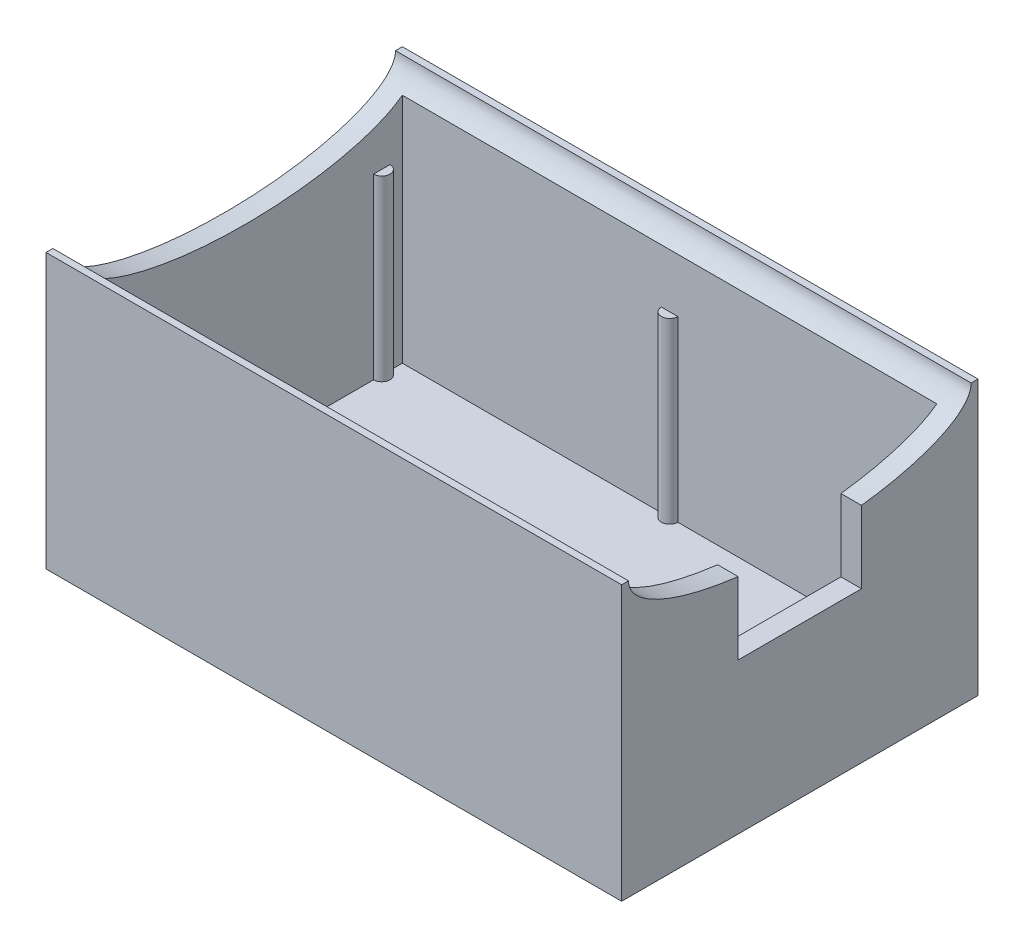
ISO-10303-21;
HEADER;
FILE_DESCRIPTION(('STEP AP214'),'2;1');
FILE_NAME('part.step','',(''),(''),'','','');
FILE_SCHEMA(('AUTOMOTIVE_DESIGN { 1 0 10303 214 1 1 1 1 }'));
ENDSEC;
DATA;
#1=APPLICATION_CONTEXT('core data for automotive mechanical design processes');
#2=APPLICATION_PROTOCOL_DEFINITION('international standard','automotive_design',2000,#1);
#3=PRODUCT_CONTEXT('',#1,'mechanical');
#4=PRODUCT('Part','Part','',(#3));
#5=PRODUCT_RELATED_PRODUCT_CATEGORY('part','',(#4));
#6=PRODUCT_DEFINITION_FORMATION('','',#4);
#7=PRODUCT_DEFINITION_CONTEXT('part definition',#1,'design');
#8=PRODUCT_DEFINITION('design','',#6,#7);
#9=PRODUCT_DEFINITION_SHAPE('','',#8);
#10=(LENGTH_UNIT() NAMED_UNIT(*) SI_UNIT(.MILLI.,.METRE.));
#11=(NAMED_UNIT(*) PLANE_ANGLE_UNIT() SI_UNIT($,.RADIAN.));
#12=(NAMED_UNIT(*) SI_UNIT($,.STERADIAN.) SOLID_ANGLE_UNIT());
#13=UNCERTAINTY_MEASURE_WITH_UNIT(LENGTH_MEASURE(1.E-05),#10,'distance_accuracy_value','');
#14=(GEOMETRIC_REPRESENTATION_CONTEXT(3) GLOBAL_UNCERTAINTY_ASSIGNED_CONTEXT((#13)) GLOBAL_UNIT_ASSIGNED_CONTEXT((#10,
#11,#12)) REPRESENTATION_CONTEXT('',''));
#15=CARTESIAN_POINT('',(0.,0.,0.));
#16=DIRECTION('',(0.,0.,1.));
#17=DIRECTION('',(1.,0.,0.));
#18=AXIS2_PLACEMENT_3D('',#15,#16,#17);
#19=CARTESIAN_POINT('',(-1.5,20.,0.));
#20=DIRECTION('',(-1.,0.,0.));
#21=DIRECTION('',(0.,0.,1.));
#22=AXIS2_PLACEMENT_3D('',#19,#20,#21);
#23=PLANE('',#22);
#24=DIRECTION('',(0.,1.,0.));
#25=VECTOR('',#24,1.);
#26=CARTESIAN_POINT('',(-1.5,20.,-8.5));
#27=LINE('',#26,#25);
#28=CARTESIAN_POINT('',(-1.5,11.,-8.5));
#29=VERTEX_POINT('',#28);
#30=CARTESIAN_POINT('',(-1.5,16.268190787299,-8.5));
#31=VERTEX_POINT('',#30);
#32=EDGE_CURVE('E240',#29,#31,#27,.T.);
#33=ORIENTED_EDGE('',*,*,#32,.F.);
#34=DIRECTION('',(0.,0.,1.));
#35=VECTOR('',#34,1.);
#36=CARTESIAN_POINT('',(-1.5,11.,0.));
#37=LINE('',#36,#35);
#38=CARTESIAN_POINT('',(-1.5,11.,-17.5));
#39=VERTEX_POINT('',#38);
#40=EDGE_CURVE('E222',#39,#29,#37,.T.);
#41=ORIENTED_EDGE('',*,*,#40,.F.);
#42=DIRECTION('',(0.,-1.,0.));
#43=VECTOR('',#42,1.);
#44=CARTESIAN_POINT('',(-1.5,20.,-17.5));
#45=LINE('',#44,#43);
#46=CARTESIAN_POINT('',(-1.5,16.268190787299,-17.5));
#47=VERTEX_POINT('',#46);
#48=EDGE_CURVE('E237',#47,#39,#45,.T.);
#49=ORIENTED_EDGE('',*,*,#48,.F.);
#50=CARTESIAN_POINT('',(-1.5,20.,-13.));
#51=DIRECTION('',(-1.,0.,0.));
#52=DIRECTION('',(0.,0.,1.));
#53=AXIS2_PLACEMENT_3D('',#50,#51,#52);
#54=ELLIPSE('',#53,12.5,4.);
#55=CARTESIAN_POINT('',(-1.5,18.4323265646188,-24.5));
#56=VERTEX_POINT('',#55);
#57=EDGE_CURVE('E416',#56,#47,#54,.T.);
#58=ORIENTED_EDGE('',*,*,#57,.F.);
#59=DIRECTION('',(0.,-1.,0.));
#60=VECTOR('',#59,1.);
#61=CARTESIAN_POINT('',(-1.5,20.,-24.5));
#62=LINE('',#61,#60);
#63=CARTESIAN_POINT('',(-1.5,1.5,-24.5));
#64=VERTEX_POINT('',#63);
#65=EDGE_CURVE('E431',#56,#64,#62,.T.);
#66=ORIENTED_EDGE('',*,*,#65,.T.);
#67=DIRECTION('',(0.,0.,-1.));
#68=VECTOR('',#67,1.);
#69=CARTESIAN_POINT('',(-1.5,1.5,0.));
#70=LINE('',#69,#68);
#71=CARTESIAN_POINT('',(-1.5,1.5,-23.6));
#72=VERTEX_POINT('',#71);
#73=EDGE_CURVE('E474',#72,#64,#70,.T.);
#74=ORIENTED_EDGE('',*,*,#73,.F.);
#75=DIRECTION('',(0.,-1.,0.));
#76=VECTOR('',#75,1.);
#77=CARTESIAN_POINT('',(-1.5,14.5,-23.6));
#78=LINE('',#77,#76);
#79=CARTESIAN_POINT('',(-1.5,14.5,-23.6));
#80=VERTEX_POINT('',#79);
#81=EDGE_CURVE('E408',#72,#80,#78,.F.);
#82=ORIENTED_EDGE('',*,*,#81,.T.);
#83=DIRECTION('',(0.,0.,-1.));
#84=VECTOR('',#83,1.);
#85=CARTESIAN_POINT('',(-1.5,14.5,0.));
#86=LINE('',#85,#84);
#87=CARTESIAN_POINT('',(-1.5,14.5,-22.4));
#88=VERTEX_POINT('',#87);
#89=EDGE_CURVE('E402',#88,#80,#86,.T.);
#90=ORIENTED_EDGE('',*,*,#89,.F.);
#91=DIRECTION('',(0.,-1.,0.));
#92=VECTOR('',#91,1.);
#93=CARTESIAN_POINT('',(-1.5,14.5,-22.4));
#94=LINE('',#93,#92);
#95=CARTESIAN_POINT('',(-1.5,1.5,-22.4));
#96=VERTEX_POINT('',#95);
#97=EDGE_CURVE('E405',#88,#96,#94,.T.);
#98=ORIENTED_EDGE('',*,*,#97,.T.);
#99=CARTESIAN_POINT('',(-1.5,1.5,-3.6));
#100=VERTEX_POINT('',#99);
#101=EDGE_CURVE('E473',#100,#96,#70,.T.);
#102=ORIENTED_EDGE('',*,*,#101,.F.);
#103=DIRECTION('',(0.,-1.,0.));
#104=VECTOR('',#103,1.);
#105=CARTESIAN_POINT('',(-1.5,14.5,-3.6));
#106=LINE('',#105,#104);
#107=CARTESIAN_POINT('',(-1.5,14.5,-3.6));
#108=VERTEX_POINT('',#107);
#109=EDGE_CURVE('E64',#100,#108,#106,.F.);
#110=ORIENTED_EDGE('',*,*,#109,.T.);
#111=DIRECTION('',(0.,0.,-1.));
#112=VECTOR('',#111,1.);
#113=CARTESIAN_POINT('',(-1.5,14.5,0.));
#114=LINE('',#113,#112);
#115=CARTESIAN_POINT('',(-1.5,14.5,-2.4));
#116=VERTEX_POINT('',#115);
#117=EDGE_CURVE('E412',#116,#108,#114,.T.);
#118=ORIENTED_EDGE('',*,*,#117,.F.);
#119=DIRECTION('',(0.,-1.,0.));
#120=VECTOR('',#119,1.);
#121=CARTESIAN_POINT('',(-1.5,14.5,-2.4));
#122=LINE('',#121,#120);
#123=CARTESIAN_POINT('',(-1.5,1.5,-2.4));
#124=VERTEX_POINT('',#123);
#125=EDGE_CURVE('E246',#116,#124,#122,.T.);
#126=ORIENTED_EDGE('',*,*,#125,.T.);
#127=CARTESIAN_POINT('',(-1.5,1.5,-1.5));
#128=VERTEX_POINT('',#127);
#129=EDGE_CURVE('E443',#128,#124,#70,.T.);
#130=ORIENTED_EDGE('',*,*,#129,.F.);
#131=DIRECTION('',(0.,-1.,0.));
#132=VECTOR('',#131,1.);
#133=CARTESIAN_POINT('',(-1.5,20.,-1.5));
#134=LINE('',#133,#132);
#135=CARTESIAN_POINT('',(-1.5,18.4323265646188,-1.5));
#136=VERTEX_POINT('',#135);
#137=EDGE_CURVE('E445',#136,#128,#134,.T.);
#138=ORIENTED_EDGE('',*,*,#137,.F.);
#139=EDGE_CURVE('E481',#31,#136,#54,.T.);
#140=ORIENTED_EDGE('',*,*,#139,.F.);
#141=EDGE_LOOP('',(#33,#41,#49,#58,#66,#74,#82,#90,#98,#102,#110,#118,#126,#130,#138,#140));
#142=FACE_BOUND('',#141,.T.);
#143=ADVANCED_FACE('F41',(#142),#23,.T.);
#144=CARTESIAN_POINT('',(0.,20.,-24.5));
#145=DIRECTION('',(0.,0.,1.));
#146=DIRECTION('',(1.,0.,0.));
#147=AXIS2_PLACEMENT_3D('',#144,#145,#146);
#148=PLANE('',#147);
#149=DIRECTION('',(-1.,0.,0.));
#150=VECTOR('',#149,1.);
#151=CARTESIAN_POINT('',(0.,1.5,-24.5));
#152=LINE('',#151,#150);
#153=CARTESIAN_POINT('',(-21.6,1.5,-24.5));
#154=VERTEX_POINT('',#153);
#155=CARTESIAN_POINT('',(-40.5,1.5,-24.5));
#156=VERTEX_POINT('',#155);
#157=EDGE_CURVE('E451',#154,#156,#152,.T.);
#158=ORIENTED_EDGE('',*,*,#157,.F.);
#159=DIRECTION('',(0.,-1.,0.));
#160=VECTOR('',#159,1.);
#161=CARTESIAN_POINT('',(-21.6,14.5,-24.5));
#162=LINE('',#161,#160);
#163=CARTESIAN_POINT('',(-21.6,14.5,-24.5));
#164=VERTEX_POINT('',#163);
#165=EDGE_CURVE('E400',#154,#164,#162,.F.);
#166=ORIENTED_EDGE('',*,*,#165,.T.);
#167=DIRECTION('',(-1.,0.,0.));
#168=VECTOR('',#167,1.);
#169=CARTESIAN_POINT('',(0.,14.5,-24.5));
#170=LINE('',#169,#168);
#171=CARTESIAN_POINT('',(-20.4,14.5,-24.5));
#172=VERTEX_POINT('',#171);
#173=EDGE_CURVE('E395',#172,#164,#170,.T.);
#174=ORIENTED_EDGE('',*,*,#173,.F.);
#175=DIRECTION('',(0.,-1.,0.));
#176=VECTOR('',#175,1.);
#177=CARTESIAN_POINT('',(-20.4,14.5,-24.5));
#178=LINE('',#177,#176);
#179=CARTESIAN_POINT('',(-20.4,1.5,-24.5));
#180=VERTEX_POINT('',#179);
#181=EDGE_CURVE('E398',#172,#180,#178,.T.);
#182=ORIENTED_EDGE('',*,*,#181,.T.);
#183=EDGE_CURVE('E448',#64,#180,#152,.T.);
#184=ORIENTED_EDGE('',*,*,#183,.F.);
#185=ORIENTED_EDGE('',*,*,#65,.F.);
#186=DIRECTION('',(-1.,0.,0.));
#187=VECTOR('',#186,1.);
#188=CARTESIAN_POINT('',(0.,18.4323265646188,-24.5));
#189=LINE('',#188,#187);
#190=CARTESIAN_POINT('',(-40.5,18.4323265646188,-24.5));
#191=VERTEX_POINT('',#190);
#192=EDGE_CURVE('E482',#191,#56,#189,.F.);
#193=ORIENTED_EDGE('',*,*,#192,.F.);
#194=DIRECTION('',(0.,-1.,0.));
#195=VECTOR('',#194,1.);
#196=CARTESIAN_POINT('',(-40.5,20.,-24.5));
#197=LINE('',#196,#195);
#198=EDGE_CURVE('E433',#191,#156,#197,.T.);
#199=ORIENTED_EDGE('',*,*,#198,.T.);
#200=EDGE_LOOP('',(#158,#166,#174,#182,#184,#185,#193,#199));
#201=FACE_BOUND('',#200,.T.);
#202=ADVANCED_FACE('F304',(#201),#148,.T.);
#203=CARTESIAN_POINT('',(0.,20.,-1.5));
#204=DIRECTION('',(0.,0.,-1.));
#205=DIRECTION('',(-1.,0.,0.));
#206=AXIS2_PLACEMENT_3D('',#203,#204,#205);
#207=PLANE('',#206);
#208=DIRECTION('',(1.,0.,0.));
#209=VECTOR('',#208,1.);
#210=CARTESIAN_POINT('',(0.,1.5,-1.5));
#211=LINE('',#210,#209);
#212=CARTESIAN_POINT('',(-20.4,1.5,-1.5));
#213=VERTEX_POINT('',#212);
#214=EDGE_CURVE('E455',#213,#128,#211,.T.);
#215=ORIENTED_EDGE('',*,*,#214,.F.);
#216=DIRECTION('',(0.,-1.,0.));
#217=VECTOR('',#216,1.);
#218=CARTESIAN_POINT('',(-20.4,14.5,-1.5));
#219=LINE('',#218,#217);
#220=CARTESIAN_POINT('',(-20.4,14.5,-1.5));
#221=VERTEX_POINT('',#220);
#222=EDGE_CURVE('E393',#213,#221,#219,.F.);
#223=ORIENTED_EDGE('',*,*,#222,.T.);
#224=DIRECTION('',(1.,0.,0.));
#225=VECTOR('',#224,1.);
#226=CARTESIAN_POINT('',(0.,14.5,-1.5));
#227=LINE('',#226,#225);
#228=CARTESIAN_POINT('',(-21.6,14.5,-1.5));
#229=VERTEX_POINT('',#228);
#230=EDGE_CURVE('E388',#229,#221,#227,.T.);
#231=ORIENTED_EDGE('',*,*,#230,.F.);
#232=DIRECTION('',(0.,-1.,0.));
#233=VECTOR('',#232,1.);
#234=CARTESIAN_POINT('',(-21.6,14.5,-1.5));
#235=LINE('',#234,#233);
#236=CARTESIAN_POINT('',(-21.6,1.5,-1.5));
#237=VERTEX_POINT('',#236);
#238=EDGE_CURVE('E391',#229,#237,#235,.T.);
#239=ORIENTED_EDGE('',*,*,#238,.T.);
#240=CARTESIAN_POINT('',(-40.5,1.5,-1.5));
#241=VERTEX_POINT('',#240);
#242=EDGE_CURVE('E426',#241,#237,#211,.T.);
#243=ORIENTED_EDGE('',*,*,#242,.F.);
#244=DIRECTION('',(0.,-1.,0.));
#245=VECTOR('',#244,1.);
#246=CARTESIAN_POINT('',(-40.5,20.,-1.5));
#247=LINE('',#246,#245);
#248=CARTESIAN_POINT('',(-40.5,18.4323265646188,-1.5));
#249=VERTEX_POINT('',#248);
#250=EDGE_CURVE('E439',#249,#241,#247,.T.);
#251=ORIENTED_EDGE('',*,*,#250,.F.);
#252=DIRECTION('',(-1.,0.,0.));
#253=VECTOR('',#252,1.);
#254=CARTESIAN_POINT('',(0.,18.4323265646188,-1.5));
#255=LINE('',#254,#253);
#256=EDGE_CURVE('E377',#136,#249,#255,.T.);
#257=ORIENTED_EDGE('',*,*,#256,.F.);
#258=ORIENTED_EDGE('',*,*,#137,.T.);
#259=EDGE_LOOP('',(#215,#223,#231,#239,#243,#251,#257,#258));
#260=FACE_BOUND('',#259,.T.);
#261=ADVANCED_FACE('F308',(#260),#207,.T.);
#262=CARTESIAN_POINT('',(-40.5,20.,0.));
#263=DIRECTION('',(1.,0.,0.));
#264=DIRECTION('',(0.,0.,-1.));
#265=AXIS2_PLACEMENT_3D('',#262,#263,#264);
#266=PLANE('',#265);
#267=DIRECTION('',(0.,0.,1.));
#268=VECTOR('',#267,1.);
#269=CARTESIAN_POINT('',(-40.5,1.5,0.));
#270=LINE('',#269,#268);
#271=CARTESIAN_POINT('',(-40.5,1.5,-2.4));
#272=VERTEX_POINT('',#271);
#273=EDGE_CURVE('E450',#272,#241,#270,.T.);
#274=ORIENTED_EDGE('',*,*,#273,.F.);
#275=DIRECTION('',(0.,-1.,0.));
#276=VECTOR('',#275,1.);
#277=CARTESIAN_POINT('',(-40.5,14.5,-2.4));
#278=LINE('',#277,#276);
#279=CARTESIAN_POINT('',(-40.5,14.5,-2.4));
#280=VERTEX_POINT('',#279);
#281=EDGE_CURVE('E276',#272,#280,#278,.F.);
#282=ORIENTED_EDGE('',*,*,#281,.T.);
#283=DIRECTION('',(0.,0.,1.));
#284=VECTOR('',#283,1.);
#285=CARTESIAN_POINT('',(-40.5,14.5,0.));
#286=LINE('',#285,#284);
#287=CARTESIAN_POINT('',(-40.5,14.5,-3.6));
#288=VERTEX_POINT('',#287);
#289=EDGE_CURVE('E386',#288,#280,#286,.T.);
#290=ORIENTED_EDGE('',*,*,#289,.F.);
#291=DIRECTION('',(0.,-1.,0.));
#292=VECTOR('',#291,1.);
#293=CARTESIAN_POINT('',(-40.5,14.5,-3.6));
#294=LINE('',#293,#292);
#295=CARTESIAN_POINT('',(-40.5,1.5,-3.6));
#296=VERTEX_POINT('',#295);
#297=EDGE_CURVE('E271',#288,#296,#294,.T.);
#298=ORIENTED_EDGE('',*,*,#297,.T.);
#299=CARTESIAN_POINT('',(-40.5,1.5,-22.4));
#300=VERTEX_POINT('',#299);
#301=EDGE_CURVE('E456',#300,#296,#270,.T.);
#302=ORIENTED_EDGE('',*,*,#301,.F.);
#303=DIRECTION('',(0.,-1.,0.));
#304=VECTOR('',#303,1.);
#305=CARTESIAN_POINT('',(-40.5,14.5,-22.4));
#306=LINE('',#305,#304);
#307=CARTESIAN_POINT('',(-40.5,14.5,-22.4));
#308=VERTEX_POINT('',#307);
#309=EDGE_CURVE('E384',#300,#308,#306,.F.);
#310=ORIENTED_EDGE('',*,*,#309,.T.);
#311=DIRECTION('',(0.,0.,1.));
#312=VECTOR('',#311,1.);
#313=CARTESIAN_POINT('',(-40.5,14.5,0.));
#314=LINE('',#313,#312);
#315=CARTESIAN_POINT('',(-40.5,14.5,-23.6));
#316=VERTEX_POINT('',#315);
#317=EDGE_CURVE('E379',#316,#308,#314,.T.);
#318=ORIENTED_EDGE('',*,*,#317,.F.);
#319=DIRECTION('',(0.,-1.,0.));
#320=VECTOR('',#319,1.);
#321=CARTESIAN_POINT('',(-40.5,14.5,-23.6));
#322=LINE('',#321,#320);
#323=CARTESIAN_POINT('',(-40.5,1.5,-23.6));
#324=VERTEX_POINT('',#323);
#325=EDGE_CURVE('E382',#316,#324,#322,.T.);
#326=ORIENTED_EDGE('',*,*,#325,.T.);
#327=EDGE_CURVE('E453',#156,#324,#270,.T.);
#328=ORIENTED_EDGE('',*,*,#327,.F.);
#329=ORIENTED_EDGE('',*,*,#198,.F.);
#330=CARTESIAN_POINT('',(-40.5,20.,-13.));
#331=DIRECTION('',(-1.,0.,0.));
#332=DIRECTION('',(0.,0.,1.));
#333=AXIS2_PLACEMENT_3D('',#330,#331,#332);
#334=ELLIPSE('',#333,12.5,4.);
#335=EDGE_CURVE('E289',#249,#191,#334,.F.);
#336=ORIENTED_EDGE('',*,*,#335,.F.);
#337=ORIENTED_EDGE('',*,*,#250,.T.);
#338=EDGE_LOOP('',(#274,#282,#290,#298,#302,#310,#318,#326,#328,#329,#336,#337));
#339=FACE_BOUND('',#338,.T.);
#340=ADVANCED_FACE('F310',(#339),#266,.T.);
#341=CARTESIAN_POINT('',(0.,20.,0.));
#342=DIRECTION('',(0.,1.,0.));
#343=DIRECTION('',(0.,0.,1.));
#344=AXIS2_PLACEMENT_3D('',#341,#342,#343);
#345=PLANE('',#344);
#346=DIRECTION('',(-1.,0.,0.));
#347=VECTOR('',#346,1.);
#348=CARTESIAN_POINT('',(0.,20.,-25.5));
#349=LINE('',#348,#347);
#350=CARTESIAN_POINT('',(0.,20.,-25.5));
#351=VERTEX_POINT('',#350);
#352=CARTESIAN_POINT('',(-42.,20.,-25.5));
#353=VERTEX_POINT('',#352);
#354=EDGE_CURVE('E475',#351,#353,#349,.T.);
#355=ORIENTED_EDGE('',*,*,#354,.F.);
#356=DIRECTION('',(0.,0.,-1.));
#357=VECTOR('',#356,1.);
#358=CARTESIAN_POINT('',(0.,20.,0.));
#359=LINE('',#358,#357);
#360=CARTESIAN_POINT('',(0.,20.,-26.));
#361=VERTEX_POINT('',#360);
#362=EDGE_CURVE('E367',#351,#361,#359,.T.);
#363=ORIENTED_EDGE('',*,*,#362,.T.);
#364=DIRECTION('',(-1.,0.,0.));
#365=VECTOR('',#364,1.);
#366=CARTESIAN_POINT('',(0.,20.,-26.));
#367=LINE('',#366,#365);
#368=CARTESIAN_POINT('',(-42.,20.,-26.));
#369=VERTEX_POINT('',#368);
#370=EDGE_CURVE('E423',#361,#369,#367,.T.);
#371=ORIENTED_EDGE('',*,*,#370,.T.);
#372=DIRECTION('',(0.,0.,1.));
#373=VECTOR('',#372,1.);
#374=CARTESIAN_POINT('',(-42.,20.,0.));
#375=LINE('',#374,#373);
#376=EDGE_CURVE('E361',#369,#353,#375,.T.);
#377=ORIENTED_EDGE('',*,*,#376,.T.);
#378=EDGE_LOOP('',(#355,#363,#371,#377));
#379=FACE_BOUND('',#378,.T.);
#380=ADVANCED_FACE('F313',(#379),#345,.T.);
#381=CARTESIAN_POINT('',(0.,20.,0.));
#382=DIRECTION('',(-1.,0.,0.));
#383=DIRECTION('',(0.,0.,1.));
#384=AXIS2_PLACEMENT_3D('',#381,#382,#383);
#385=PLANE('',#384);
#386=DIRECTION('',(0.,0.,-1.));
#387=VECTOR('',#386,1.);
#388=CARTESIAN_POINT('',(0.,11.,-8.5));
#389=LINE('',#388,#387);
#390=CARTESIAN_POINT('',(0.,11.,-8.5));
#391=VERTEX_POINT('',#390);
#392=CARTESIAN_POINT('',(0.,11.,-17.5));
#393=VERTEX_POINT('',#392);
#394=EDGE_CURVE('E220',#391,#393,#389,.T.);
#395=ORIENTED_EDGE('',*,*,#394,.F.);
#396=DIRECTION('',(0.,-1.,0.));
#397=VECTOR('',#396,1.);
#398=CARTESIAN_POINT('',(0.,20.8938766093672,-8.5));
#399=LINE('',#398,#397);
#400=CARTESIAN_POINT('',(0.,16.268190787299,-8.5));
#401=VERTEX_POINT('',#400);
#402=EDGE_CURVE('E228',#401,#391,#399,.T.);
#403=ORIENTED_EDGE('',*,*,#402,.F.);
#404=CARTESIAN_POINT('',(0.,20.,-13.));
#405=DIRECTION('',(-1.,0.,0.));
#406=DIRECTION('',(0.,0.,1.));
#407=AXIS2_PLACEMENT_3D('',#404,#405,#406);
#408=ELLIPSE('',#407,12.5,4.);
#409=CARTESIAN_POINT('',(0.,20.,-0.499999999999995));
#410=VERTEX_POINT('',#409);
#411=EDGE_CURVE('E290',#401,#410,#408,.T.);
#412=ORIENTED_EDGE('',*,*,#411,.T.);
#413=CARTESIAN_POINT('',(0.,20.,0.));
#414=VERTEX_POINT('',#413);
#415=EDGE_CURVE('E420',#414,#410,#359,.T.);
#416=ORIENTED_EDGE('',*,*,#415,.F.);
#417=DIRECTION('',(0.,-1.,0.));
#418=VECTOR('',#417,1.);
#419=CARTESIAN_POINT('',(0.,20.,0.));
#420=LINE('',#419,#418);
#421=CARTESIAN_POINT('',(0.,0.,0.));
#422=VERTEX_POINT('',#421);
#423=EDGE_CURVE('E371',#414,#422,#420,.T.);
#424=ORIENTED_EDGE('',*,*,#423,.T.);
#425=DIRECTION('',(0.,0.,-1.));
#426=VECTOR('',#425,1.);
#427=CARTESIAN_POINT('',(0.,0.,0.));
#428=LINE('',#427,#426);
#429=CARTESIAN_POINT('',(0.,0.,-26.));
#430=VERTEX_POINT('',#429);
#431=EDGE_CURVE('E354',#422,#430,#428,.T.);
#432=ORIENTED_EDGE('',*,*,#431,.T.);
#433=DIRECTION('',(0.,-1.,0.));
#434=VECTOR('',#433,1.);
#435=CARTESIAN_POINT('',(0.,20.,-26.));
#436=LINE('',#435,#434);
#437=EDGE_CURVE('E349',#361,#430,#436,.T.);
#438=ORIENTED_EDGE('',*,*,#437,.F.);
#439=ORIENTED_EDGE('',*,*,#362,.F.);
#440=CARTESIAN_POINT('',(0.,16.268190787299,-17.5));
#441=VERTEX_POINT('',#440);
#442=EDGE_CURVE('E286',#351,#441,#408,.T.);
#443=ORIENTED_EDGE('',*,*,#442,.T.);
#444=DIRECTION('',(0.,1.,0.));
#445=VECTOR('',#444,1.);
#446=CARTESIAN_POINT('',(0.,20.8938766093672,-17.5));
#447=LINE('',#446,#445);
#448=EDGE_CURVE('E56',#393,#441,#447,.T.);
#449=ORIENTED_EDGE('',*,*,#448,.F.);
#450=EDGE_LOOP('',(#395,#403,#412,#416,#424,#432,#438,#439,#443,#449));
#451=FACE_BOUND('',#450,.T.);
#452=ADVANCED_FACE('F43',(#451),#385,.F.);
#453=CARTESIAN_POINT('',(0.,20.,-26.));
#454=DIRECTION('',(0.,0.,1.));
#455=DIRECTION('',(1.,0.,0.));
#456=AXIS2_PLACEMENT_3D('',#453,#454,#455);
#457=PLANE('',#456);
#458=DIRECTION('',(-1.,0.,0.));
#459=VECTOR('',#458,1.);
#460=CARTESIAN_POINT('',(0.,0.,-26.));
#461=LINE('',#460,#459);
#462=CARTESIAN_POINT('',(-42.,0.,-26.));
#463=VERTEX_POINT('',#462);
#464=EDGE_CURVE('E343',#430,#463,#461,.T.);
#465=ORIENTED_EDGE('',*,*,#464,.T.);
#466=DIRECTION('',(0.,-1.,0.));
#467=VECTOR('',#466,1.);
#468=CARTESIAN_POINT('',(-42.,20.,-26.));
#469=LINE('',#468,#467);
#470=EDGE_CURVE('E346',#369,#463,#469,.T.);
#471=ORIENTED_EDGE('',*,*,#470,.F.);
#472=ORIENTED_EDGE('',*,*,#370,.F.);
#473=ORIENTED_EDGE('',*,*,#437,.T.);
#474=EDGE_LOOP('',(#465,#471,#472,#473));
#475=FACE_BOUND('',#474,.T.);
#476=ADVANCED_FACE('F334',(#475),#457,.F.);
#477=CARTESIAN_POINT('',(-42.,20.,0.));
#478=DIRECTION('',(1.,0.,0.));
#479=DIRECTION('',(0.,0.,-1.));
#480=AXIS2_PLACEMENT_3D('',#477,#478,#479);
#481=PLANE('',#480);
#482=CARTESIAN_POINT('',(-42.,20.,-0.499999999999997));
#483=VERTEX_POINT('',#482);
#484=CARTESIAN_POINT('',(-42.,20.,0.));
#485=VERTEX_POINT('',#484);
#486=EDGE_CURVE('E429',#483,#485,#375,.T.);
#487=ORIENTED_EDGE('',*,*,#486,.F.);
#488=CARTESIAN_POINT('',(-42.,20.,-13.));
#489=DIRECTION('',(-1.,0.,0.));
#490=DIRECTION('',(0.,0.,1.));
#491=AXIS2_PLACEMENT_3D('',#488,#489,#490);
#492=ELLIPSE('',#491,12.5,4.);
#493=EDGE_CURVE('E283',#353,#483,#492,.T.);
#494=ORIENTED_EDGE('',*,*,#493,.F.);
#495=ORIENTED_EDGE('',*,*,#376,.F.);
#496=ORIENTED_EDGE('',*,*,#470,.T.);
#497=DIRECTION('',(0.,0.,1.));
#498=VECTOR('',#497,1.);
#499=CARTESIAN_POINT('',(-42.,0.,0.));
#500=LINE('',#499,#498);
#501=CARTESIAN_POINT('',(-42.,0.,0.));
#502=VERTEX_POINT('',#501);
#503=EDGE_CURVE('E353',#463,#502,#500,.T.);
#504=ORIENTED_EDGE('',*,*,#503,.T.);
#505=DIRECTION('',(0.,-1.,0.));
#506=VECTOR('',#505,1.);
#507=CARTESIAN_POINT('',(-42.,20.,0.));
#508=LINE('',#507,#506);
#509=EDGE_CURVE('E362',#485,#502,#508,.T.);
#510=ORIENTED_EDGE('',*,*,#509,.F.);
#511=EDGE_LOOP('',(#487,#494,#495,#496,#504,#510));
#512=FACE_BOUND('',#511,.T.);
#513=ADVANCED_FACE('F331',(#512),#481,.F.);
#514=CARTESIAN_POINT('',(0.,20.,0.));
#515=DIRECTION('',(0.,0.,-1.));
#516=DIRECTION('',(-1.,0.,0.));
#517=AXIS2_PLACEMENT_3D('',#514,#515,#516);
#518=PLANE('',#517);
#519=DIRECTION('',(1.,0.,0.));
#520=VECTOR('',#519,1.);
#521=CARTESIAN_POINT('',(0.,0.,0.));
#522=LINE('',#521,#520);
#523=EDGE_CURVE('E365',#502,#422,#522,.T.);
#524=ORIENTED_EDGE('',*,*,#523,.T.);
#525=ORIENTED_EDGE('',*,*,#423,.F.);
#526=DIRECTION('',(1.,0.,0.));
#527=VECTOR('',#526,1.);
#528=CARTESIAN_POINT('',(0.,20.,0.));
#529=LINE('',#528,#527);
#530=EDGE_CURVE('E374',#485,#414,#529,.T.);
#531=ORIENTED_EDGE('',*,*,#530,.F.);
#532=ORIENTED_EDGE('',*,*,#509,.T.);
#533=EDGE_LOOP('',(#524,#525,#531,#532));
#534=FACE_BOUND('',#533,.T.);
#535=ADVANCED_FACE('F324',(#534),#518,.F.);
#536=DIRECTION('',(-1.,0.,0.));
#537=VECTOR('',#536,1.);
#538=CARTESIAN_POINT('',(0.,20.,-0.499999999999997));
#539=LINE('',#538,#537);
#540=EDGE_CURVE('E476',#483,#410,#539,.F.);
#541=ORIENTED_EDGE('',*,*,#540,.F.);
#542=ORIENTED_EDGE('',*,*,#486,.T.);
#543=ORIENTED_EDGE('',*,*,#530,.T.);
#544=ORIENTED_EDGE('',*,*,#415,.T.);
#545=EDGE_LOOP('',(#541,#542,#543,#544));
#546=FACE_BOUND('',#545,.T.);
#547=ADVANCED_FACE('F321',(#546),#345,.T.);
#548=CARTESIAN_POINT('',(0.,0.,0.));
#549=DIRECTION('',(0.,1.,0.));
#550=DIRECTION('',(0.,0.,1.));
#551=AXIS2_PLACEMENT_3D('',#548,#549,#550);
#552=PLANE('',#551);
#553=ORIENTED_EDGE('',*,*,#431,.F.);
#554=ORIENTED_EDGE('',*,*,#523,.F.);
#555=ORIENTED_EDGE('',*,*,#503,.F.);
#556=ORIENTED_EDGE('',*,*,#464,.F.);
#557=EDGE_LOOP('',(#553,#554,#555,#556));
#558=FACE_BOUND('',#557,.T.);
#559=ADVANCED_FACE('F298',(#558),#552,.F.);
#560=DIRECTION('',(-1.,0.,0.));
#561=VECTOR('',#560,1.);
#562=SURFACE_OF_LINEAR_EXTRUSION('',#408,#561);
#563=ORIENTED_EDGE('',*,*,#411,.F.);
#564=DIRECTION('',(-1.,0.,0.));
#565=VECTOR('',#564,1.);
#566=CARTESIAN_POINT('',(0.,16.268190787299,-8.5));
#567=LINE('',#566,#565);
#568=EDGE_CURVE('E11',#401,#31,#567,.T.);
#569=ORIENTED_EDGE('',*,*,#568,.T.);
#570=ORIENTED_EDGE('',*,*,#139,.T.);
#571=ORIENTED_EDGE('',*,*,#256,.T.);
#572=ORIENTED_EDGE('',*,*,#335,.T.);
#573=ORIENTED_EDGE('',*,*,#192,.T.);
#574=ORIENTED_EDGE('',*,*,#57,.T.);
#575=DIRECTION('',(-1.,0.,0.));
#576=VECTOR('',#575,1.);
#577=CARTESIAN_POINT('',(0.,16.268190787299,-17.5));
#578=LINE('',#577,#576);
#579=EDGE_CURVE('E49',#47,#441,#578,.F.);
#580=ORIENTED_EDGE('',*,*,#579,.T.);
#581=ORIENTED_EDGE('',*,*,#442,.F.);
#582=ORIENTED_EDGE('',*,*,#354,.T.);
#583=ORIENTED_EDGE('',*,*,#493,.T.);
#584=ORIENTED_EDGE('',*,*,#540,.T.);
#585=EDGE_LOOP('',(#563,#569,#570,#571,#572,#573,#574,#580,#581,#582,#583,#584));
#586=FACE_BOUND('',#585,.T.);
#587=ADVANCED_FACE('F293',(#586),#562,.F.);
#588=CARTESIAN_POINT('',(0.,1.5,0.));
#589=DIRECTION('',(0.,1.,0.));
#590=DIRECTION('',(0.,0.,1.));
#591=AXIS2_PLACEMENT_3D('',#588,#589,#590);
#592=PLANE('',#591);
#593=ORIENTED_EDGE('',*,*,#129,.T.);
#594=CARTESIAN_POINT('',(-1.5,1.5,-3.));
#595=DIRECTION('',(0.,1.,0.));
#596=DIRECTION('',(0.,0.,1.));
#597=AXIS2_PLACEMENT_3D('',#594,#595,#596);
#598=CIRCLE('',#597,0.6);
#599=EDGE_CURVE('E410',#124,#100,#598,.F.);
#600=ORIENTED_EDGE('',*,*,#599,.T.);
#601=ORIENTED_EDGE('',*,*,#101,.T.);
#602=CARTESIAN_POINT('',(-1.5,1.5,-23.));
#603=DIRECTION('',(0.,1.,0.));
#604=DIRECTION('',(0.,0.,1.));
#605=AXIS2_PLACEMENT_3D('',#602,#603,#604);
#606=CIRCLE('',#605,0.6);
#607=EDGE_CURVE('E251',#72,#96,#606,.T.);
#608=ORIENTED_EDGE('',*,*,#607,.F.);
#609=ORIENTED_EDGE('',*,*,#73,.T.);
#610=ORIENTED_EDGE('',*,*,#183,.T.);
#611=CARTESIAN_POINT('',(-21.,1.5,-24.5));
#612=DIRECTION('',(0.,1.,0.));
#613=DIRECTION('',(0.,0.,1.));
#614=AXIS2_PLACEMENT_3D('',#611,#612,#613);
#615=CIRCLE('',#614,0.6);
#616=EDGE_CURVE('E257',#154,#180,#615,.T.);
#617=ORIENTED_EDGE('',*,*,#616,.F.);
#618=ORIENTED_EDGE('',*,*,#157,.T.);
#619=ORIENTED_EDGE('',*,*,#327,.T.);
#620=CARTESIAN_POINT('',(-40.5,1.5,-23.));
#621=DIRECTION('',(0.,1.,0.));
#622=DIRECTION('',(0.,0.,1.));
#623=AXIS2_PLACEMENT_3D('',#620,#621,#622);
#624=CIRCLE('',#623,0.6);
#625=EDGE_CURVE('E279',#300,#324,#624,.T.);
#626=ORIENTED_EDGE('',*,*,#625,.F.);
#627=ORIENTED_EDGE('',*,*,#301,.T.);
#628=CARTESIAN_POINT('',(-40.5,1.5,-3.));
#629=DIRECTION('',(0.,1.,0.));
#630=DIRECTION('',(0.,0.,1.));
#631=AXIS2_PLACEMENT_3D('',#628,#629,#630);
#632=CIRCLE('',#631,0.600000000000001);
#633=EDGE_CURVE('E269',#272,#296,#632,.T.);
#634=ORIENTED_EDGE('',*,*,#633,.F.);
#635=ORIENTED_EDGE('',*,*,#273,.T.);
#636=ORIENTED_EDGE('',*,*,#242,.T.);
#637=CARTESIAN_POINT('',(-21.,1.5,-1.5));
#638=DIRECTION('',(0.,1.,0.));
#639=DIRECTION('',(0.,0.,1.));
#640=AXIS2_PLACEMENT_3D('',#637,#638,#639);
#641=CIRCLE('',#640,0.6);
#642=EDGE_CURVE('E263',#213,#237,#641,.T.);
#643=ORIENTED_EDGE('',*,*,#642,.F.);
#644=ORIENTED_EDGE('',*,*,#214,.T.);
#645=EDGE_LOOP('',(#593,#600,#601,#608,#609,#610,#617,#618,#619,#626,#627,#634,#635,#636,#643,#644));
#646=FACE_BOUND('',#645,.T.);
#647=ADVANCED_FACE('F297',(#646),#592,.T.);
#648=CARTESIAN_POINT('',(-40.5,14.5,-23.));
#649=DIRECTION('',(0.,-1.,0.));
#650=DIRECTION('',(0.,0.,-1.));
#651=AXIS2_PLACEMENT_3D('',#648,#649,#650);
#652=CYLINDRICAL_SURFACE('',#651,0.6);
#653=ORIENTED_EDGE('',*,*,#309,.F.);
#654=ORIENTED_EDGE('',*,*,#625,.T.);
#655=ORIENTED_EDGE('',*,*,#325,.F.);
#656=CARTESIAN_POINT('',(-40.5,14.5,-23.));
#657=DIRECTION('',(0.,1.,0.));
#658=DIRECTION('',(0.,0.,1.));
#659=AXIS2_PLACEMENT_3D('',#656,#657,#658);
#660=CIRCLE('',#659,0.6);
#661=EDGE_CURVE('E280',#308,#316,#660,.T.);
#662=ORIENTED_EDGE('',*,*,#661,.F.);
#663=EDGE_LOOP('',(#653,#654,#655,#662));
#664=FACE_BOUND('',#663,.T.);
#665=ADVANCED_FACE('F300',(#664),#652,.T.);
#666=CARTESIAN_POINT('',(-40.5,14.5,-23.));
#667=DIRECTION('',(0.,1.,0.));
#668=DIRECTION('',(0.,0.,1.));
#669=AXIS2_PLACEMENT_3D('',#666,#667,#668);
#670=PLANE('',#669);
#671=ORIENTED_EDGE('',*,*,#661,.T.);
#672=ORIENTED_EDGE('',*,*,#317,.T.);
#673=EDGE_LOOP('',(#671,#672));
#674=FACE_BOUND('',#673,.T.);
#675=ADVANCED_FACE('F493',(#674),#670,.T.);
#676=CARTESIAN_POINT('',(-40.5,14.5,-3.));
#677=DIRECTION('',(0.,-1.,0.));
#678=DIRECTION('',(0.,0.,-1.));
#679=AXIS2_PLACEMENT_3D('',#676,#677,#678);
#680=CYLINDRICAL_SURFACE('',#679,0.600000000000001);
#681=ORIENTED_EDGE('',*,*,#281,.F.);
#682=ORIENTED_EDGE('',*,*,#633,.T.);
#683=ORIENTED_EDGE('',*,*,#297,.F.);
#684=CARTESIAN_POINT('',(-40.5,14.5,-3.));
#685=DIRECTION('',(0.,1.,0.));
#686=DIRECTION('',(0.,0.,1.));
#687=AXIS2_PLACEMENT_3D('',#684,#685,#686);
#688=CIRCLE('',#687,0.600000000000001);
#689=EDGE_CURVE('E266',#280,#288,#688,.T.);
#690=ORIENTED_EDGE('',*,*,#689,.F.);
#691=EDGE_LOOP('',(#681,#682,#683,#690));
#692=FACE_BOUND('',#691,.T.);
#693=ADVANCED_FACE('F495',(#692),#680,.T.);
#694=CARTESIAN_POINT('',(-40.5,14.5,-3.));
#695=DIRECTION('',(0.,1.,0.));
#696=DIRECTION('',(0.,0.,1.));
#697=AXIS2_PLACEMENT_3D('',#694,#695,#696);
#698=PLANE('',#697);
#699=ORIENTED_EDGE('',*,*,#689,.T.);
#700=ORIENTED_EDGE('',*,*,#289,.T.);
#701=EDGE_LOOP('',(#699,#700));
#702=FACE_BOUND('',#701,.T.);
#703=ADVANCED_FACE('F500',(#702),#698,.T.);
#704=CARTESIAN_POINT('',(-21.,14.5,-1.5));
#705=DIRECTION('',(0.,-1.,0.));
#706=DIRECTION('',(0.,0.,-1.));
#707=AXIS2_PLACEMENT_3D('',#704,#705,#706);
#708=CYLINDRICAL_SURFACE('',#707,0.6);
#709=ORIENTED_EDGE('',*,*,#222,.F.);
#710=ORIENTED_EDGE('',*,*,#642,.T.);
#711=ORIENTED_EDGE('',*,*,#238,.F.);
#712=CARTESIAN_POINT('',(-21.,14.5,-1.5));
#713=DIRECTION('',(0.,1.,0.));
#714=DIRECTION('',(0.,0.,1.));
#715=AXIS2_PLACEMENT_3D('',#712,#713,#714);
#716=CIRCLE('',#715,0.6);
#717=EDGE_CURVE('E260',#221,#229,#716,.T.);
#718=ORIENTED_EDGE('',*,*,#717,.F.);
#719=EDGE_LOOP('',(#709,#710,#711,#718));
#720=FACE_BOUND('',#719,.T.);
#721=ADVANCED_FACE('F505',(#720),#708,.T.);
#722=CARTESIAN_POINT('',(-21.,14.5,-1.5));
#723=DIRECTION('',(0.,1.,0.));
#724=DIRECTION('',(0.,0.,1.));
#725=AXIS2_PLACEMENT_3D('',#722,#723,#724);
#726=PLANE('',#725);
#727=ORIENTED_EDGE('',*,*,#717,.T.);
#728=ORIENTED_EDGE('',*,*,#230,.T.);
#729=EDGE_LOOP('',(#727,#728));
#730=FACE_BOUND('',#729,.T.);
#731=ADVANCED_FACE('F508',(#730),#726,.T.);
#732=CARTESIAN_POINT('',(-21.,14.5,-24.5));
#733=DIRECTION('',(0.,-1.,0.));
#734=DIRECTION('',(0.,0.,-1.));
#735=AXIS2_PLACEMENT_3D('',#732,#733,#734);
#736=CYLINDRICAL_SURFACE('',#735,0.6);
#737=ORIENTED_EDGE('',*,*,#165,.F.);
#738=ORIENTED_EDGE('',*,*,#616,.T.);
#739=ORIENTED_EDGE('',*,*,#181,.F.);
#740=CARTESIAN_POINT('',(-21.,14.5,-24.5));
#741=DIRECTION('',(0.,1.,0.));
#742=DIRECTION('',(0.,0.,1.));
#743=AXIS2_PLACEMENT_3D('',#740,#741,#742);
#744=CIRCLE('',#743,0.6);
#745=EDGE_CURVE('E254',#164,#172,#744,.T.);
#746=ORIENTED_EDGE('',*,*,#745,.F.);
#747=EDGE_LOOP('',(#737,#738,#739,#746));
#748=FACE_BOUND('',#747,.T.);
#749=ADVANCED_FACE('F511',(#748),#736,.T.);
#750=CARTESIAN_POINT('',(-21.,14.5,-24.5));
#751=DIRECTION('',(0.,1.,0.));
#752=DIRECTION('',(0.,0.,1.));
#753=AXIS2_PLACEMENT_3D('',#750,#751,#752);
#754=PLANE('',#753);
#755=ORIENTED_EDGE('',*,*,#745,.T.);
#756=ORIENTED_EDGE('',*,*,#173,.T.);
#757=EDGE_LOOP('',(#755,#756));
#758=FACE_BOUND('',#757,.T.);
#759=ADVANCED_FACE('F516',(#758),#754,.T.);
#760=CARTESIAN_POINT('',(-1.5,14.5,-23.));
#761=DIRECTION('',(0.,-1.,0.));
#762=DIRECTION('',(0.,0.,-1.));
#763=AXIS2_PLACEMENT_3D('',#760,#761,#762);
#764=CYLINDRICAL_SURFACE('',#763,0.6);
#765=ORIENTED_EDGE('',*,*,#81,.F.);
#766=ORIENTED_EDGE('',*,*,#607,.T.);
#767=ORIENTED_EDGE('',*,*,#97,.F.);
#768=CARTESIAN_POINT('',(-1.5,14.5,-23.));
#769=DIRECTION('',(0.,1.,0.));
#770=DIRECTION('',(0.,0.,1.));
#771=AXIS2_PLACEMENT_3D('',#768,#769,#770);
#772=CIRCLE('',#771,0.6);
#773=EDGE_CURVE('E250',#80,#88,#772,.T.);
#774=ORIENTED_EDGE('',*,*,#773,.F.);
#775=EDGE_LOOP('',(#765,#766,#767,#774));
#776=FACE_BOUND('',#775,.T.);
#777=ADVANCED_FACE('F519',(#776),#764,.T.);
#778=CARTESIAN_POINT('',(-1.5,14.5,-23.));
#779=DIRECTION('',(0.,1.,0.));
#780=DIRECTION('',(0.,0.,1.));
#781=AXIS2_PLACEMENT_3D('',#778,#779,#780);
#782=PLANE('',#781);
#783=ORIENTED_EDGE('',*,*,#773,.T.);
#784=ORIENTED_EDGE('',*,*,#89,.T.);
#785=EDGE_LOOP('',(#783,#784));
#786=FACE_BOUND('',#785,.T.);
#787=ADVANCED_FACE('F524',(#786),#782,.T.);
#788=CARTESIAN_POINT('',(-1.5,14.5,-3.));
#789=DIRECTION('',(0.,-1.,0.));
#790=DIRECTION('',(0.,0.,-1.));
#791=AXIS2_PLACEMENT_3D('',#788,#789,#790);
#792=CYLINDRICAL_SURFACE('',#791,0.6);
#793=ORIENTED_EDGE('',*,*,#109,.F.);
#794=ORIENTED_EDGE('',*,*,#599,.F.);
#795=ORIENTED_EDGE('',*,*,#125,.F.);
#796=CARTESIAN_POINT('',(-1.5,14.5,-3.));
#797=DIRECTION('',(0.,1.,0.));
#798=DIRECTION('',(0.,0.,1.));
#799=AXIS2_PLACEMENT_3D('',#796,#797,#798);
#800=CIRCLE('',#799,0.6);
#801=EDGE_CURVE('E243',#108,#116,#800,.T.);
#802=ORIENTED_EDGE('',*,*,#801,.F.);
#803=EDGE_LOOP('',(#793,#794,#795,#802));
#804=FACE_BOUND('',#803,.T.);
#805=ADVANCED_FACE('F527',(#804),#792,.T.);
#806=CARTESIAN_POINT('',(-1.5,14.5,-3.));
#807=DIRECTION('',(0.,1.,0.));
#808=DIRECTION('',(0.,0.,1.));
#809=AXIS2_PLACEMENT_3D('',#806,#807,#808);
#810=PLANE('',#809);
#811=ORIENTED_EDGE('',*,*,#801,.T.);
#812=ORIENTED_EDGE('',*,*,#117,.T.);
#813=EDGE_LOOP('',(#811,#812));
#814=FACE_BOUND('',#813,.T.);
#815=ADVANCED_FACE('F532',(#814),#810,.T.);
#816=CARTESIAN_POINT('',(-13.,20.8938766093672,-8.5));
#817=DIRECTION('',(0.,0.,1.));
#818=DIRECTION('',(0.,-1.,0.));
#819=AXIS2_PLACEMENT_3D('',#816,#817,#818);
#820=PLANE('',#819);
#821=ORIENTED_EDGE('',*,*,#32,.T.);
#822=ORIENTED_EDGE('',*,*,#568,.F.);
#823=ORIENTED_EDGE('',*,*,#402,.T.);
#824=DIRECTION('',(1.,0.,0.));
#825=VECTOR('',#824,1.);
#826=CARTESIAN_POINT('',(-13.,11.,-8.5));
#827=LINE('',#826,#825);
#828=EDGE_CURVE('E215',#29,#391,#827,.T.);
#829=ORIENTED_EDGE('',*,*,#828,.F.);
#830=EDGE_LOOP('',(#821,#822,#823,#829));
#831=FACE_BOUND('',#830,.T.);
#832=ADVANCED_FACE('F229',(#831),#820,.F.);
#833=CARTESIAN_POINT('',(-13.,20.8938766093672,-17.5));
#834=DIRECTION('',(0.,0.,-1.));
#835=DIRECTION('',(0.,1.,0.));
#836=AXIS2_PLACEMENT_3D('',#833,#834,#835);
#837=PLANE('',#836);
#838=ORIENTED_EDGE('',*,*,#48,.T.);
#839=DIRECTION('',(1.,0.,0.));
#840=VECTOR('',#839,1.);
#841=CARTESIAN_POINT('',(-13.,11.,-17.5));
#842=LINE('',#841,#840);
#843=EDGE_CURVE('E225',#39,#393,#842,.T.);
#844=ORIENTED_EDGE('',*,*,#843,.T.);
#845=ORIENTED_EDGE('',*,*,#448,.T.);
#846=ORIENTED_EDGE('',*,*,#579,.F.);
#847=EDGE_LOOP('',(#838,#844,#845,#846));
#848=FACE_BOUND('',#847,.T.);
#849=ADVANCED_FACE('F540',(#848),#837,.F.);
#850=CARTESIAN_POINT('',(-13.,11.,-8.5));
#851=DIRECTION('',(0.,-1.,0.));
#852=DIRECTION('',(0.,0.,-1.));
#853=AXIS2_PLACEMENT_3D('',#850,#851,#852);
#854=PLANE('',#853);
#855=ORIENTED_EDGE('',*,*,#40,.T.);
#856=ORIENTED_EDGE('',*,*,#828,.T.);
#857=ORIENTED_EDGE('',*,*,#394,.T.);
#858=ORIENTED_EDGE('',*,*,#843,.F.);
#859=EDGE_LOOP('',(#855,#856,#857,#858));
#860=FACE_BOUND('',#859,.T.);
#861=ADVANCED_FACE('F217',(#860),#854,.F.);
#862=CLOSED_SHELL('',(#143,#202,#261,#340,#380,#452,#476,#513,#535,#547,#559,#587,#647,#665,
#675,#693,#703,#721,#731,#749,#759,#777,#787,#805,#815,#832,#849,#861));
#863=MANIFOLD_SOLID_BREP('B2',#862);
#864=ADVANCED_BREP_SHAPE_REPRESENTATION('',(#18,#863),#14);
#865=SHAPE_DEFINITION_REPRESENTATION(#9,#864);
ENDSEC;
END-ISO-10303-21;
